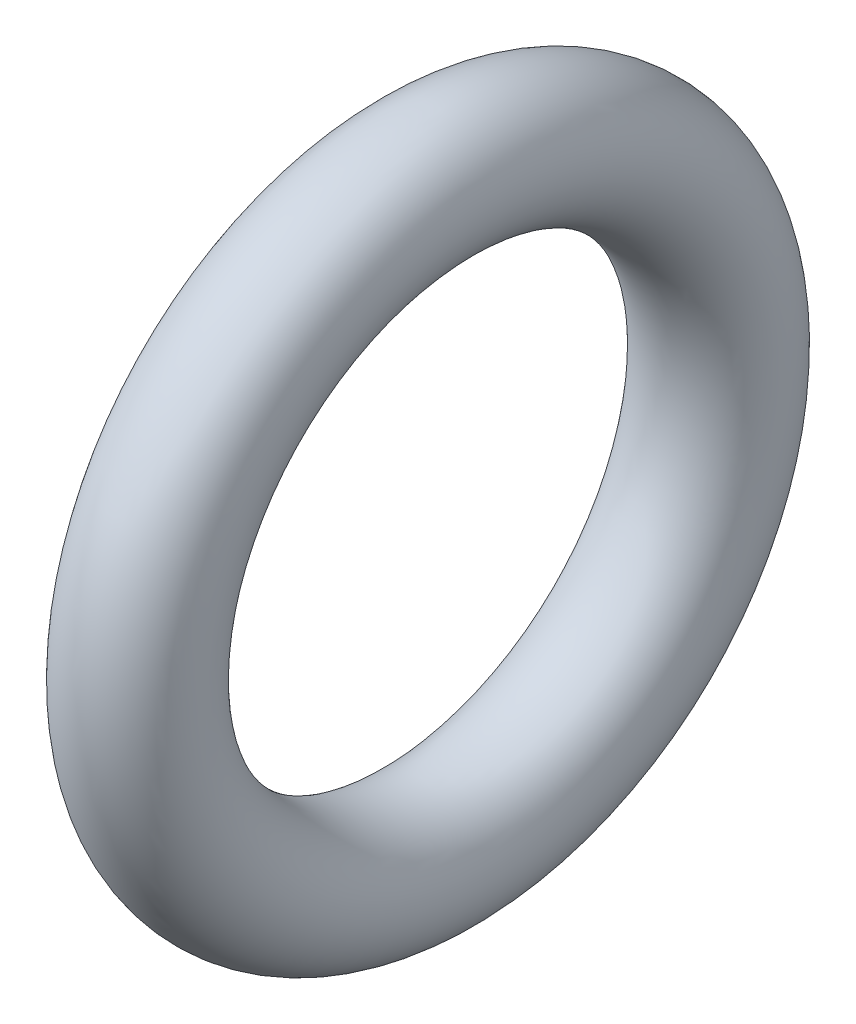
ISO-10303-21;
HEADER;
FILE_DESCRIPTION(('STEP AP214'),'2;1');
FILE_NAME('part.step','',(''),(''),'','','');
FILE_SCHEMA(('AUTOMOTIVE_DESIGN { 1 0 10303 214 1 1 1 1 }'));
ENDSEC;
DATA;
#1=APPLICATION_CONTEXT('core data for automotive mechanical design processes');
#2=APPLICATION_PROTOCOL_DEFINITION('international standard','automotive_design',2000,#1);
#3=PRODUCT_CONTEXT('',#1,'mechanical');
#4=PRODUCT('Part','Part','',(#3));
#5=PRODUCT_RELATED_PRODUCT_CATEGORY('part','',(#4));
#6=PRODUCT_DEFINITION_FORMATION('','',#4);
#7=PRODUCT_DEFINITION_CONTEXT('part definition',#1,'design');
#8=PRODUCT_DEFINITION('design','',#6,#7);
#9=PRODUCT_DEFINITION_SHAPE('','',#8);
#10=(LENGTH_UNIT() NAMED_UNIT(*) SI_UNIT(.MILLI.,.METRE.));
#11=(NAMED_UNIT(*) PLANE_ANGLE_UNIT() SI_UNIT($,.RADIAN.));
#12=(NAMED_UNIT(*) SI_UNIT($,.STERADIAN.) SOLID_ANGLE_UNIT());
#13=UNCERTAINTY_MEASURE_WITH_UNIT(LENGTH_MEASURE(1.E-05),#10,'distance_accuracy_value','');
#14=(GEOMETRIC_REPRESENTATION_CONTEXT(3) GLOBAL_UNCERTAINTY_ASSIGNED_CONTEXT((#13)) GLOBAL_UNIT_ASSIGNED_CONTEXT((#10,
#11,#12)) REPRESENTATION_CONTEXT('',''));
#15=CARTESIAN_POINT('',(0.,0.,0.));
#16=DIRECTION('',(0.,0.,1.));
#17=DIRECTION('',(1.,0.,0.));
#18=AXIS2_PLACEMENT_3D('',#15,#16,#17);
#19=CARTESIAN_POINT('',(0.,5.9055,0.));
#20=DIRECTION('',(0.,0.,1.));
#21=DIRECTION('',(1.,0.,0.));
#22=AXIS2_PLACEMENT_3D('',#19,#20,#21);
#23=ELLIPSE('',#22,1.3081,1.3081);
#24=CARTESIAN_POINT('',(-14.9542424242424,0.,0.));
#25=DIRECTION('',(-1.,0.,0.));
#26=AXIS1_PLACEMENT('',#24,#25);
#27=SURFACE_OF_REVOLUTION('',#23,#26);
#28=ADVANCED_FACE('F28',(),#27,.T.);
#29=CLOSED_SHELL('',(#28));
#30=MANIFOLD_SOLID_BREP('B2',#29);
#31=ADVANCED_BREP_SHAPE_REPRESENTATION('',(#18,#30),#14);
#32=SHAPE_DEFINITION_REPRESENTATION(#9,#31);
ENDSEC;
END-ISO-10303-21;
